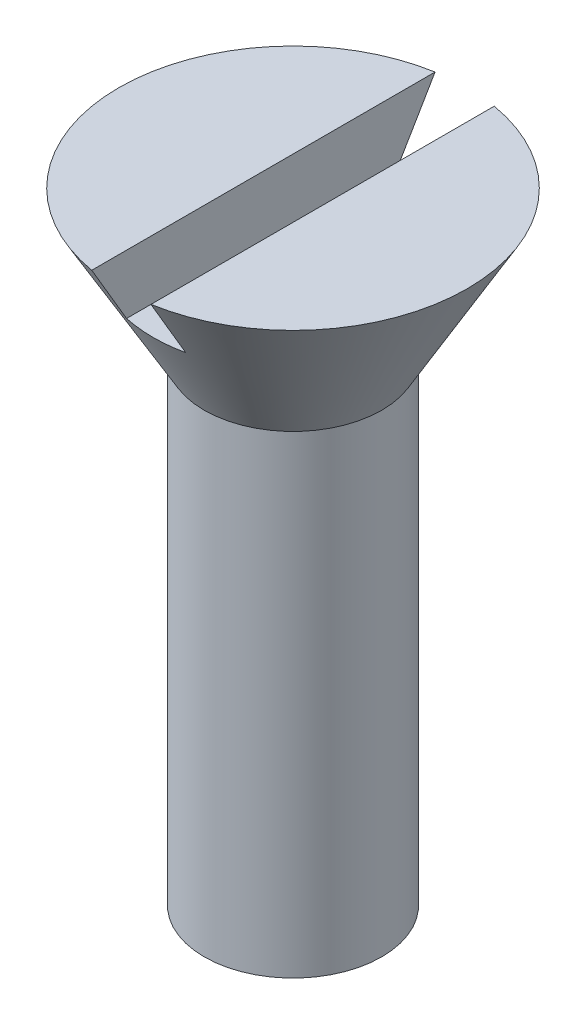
ISO-10303-21;
HEADER;
FILE_DESCRIPTION(('STEP AP214'),'2;1');
FILE_NAME('part.step','',(''),(''),'','','');
FILE_SCHEMA(('AUTOMOTIVE_DESIGN { 1 0 10303 214 1 1 1 1 }'));
ENDSEC;
DATA;
#1=APPLICATION_CONTEXT('core data for automotive mechanical design processes');
#2=APPLICATION_PROTOCOL_DEFINITION('international standard','automotive_design',2000,#1);
#3=PRODUCT_CONTEXT('',#1,'mechanical');
#4=PRODUCT('Part','Part','',(#3));
#5=PRODUCT_RELATED_PRODUCT_CATEGORY('part','',(#4));
#6=PRODUCT_DEFINITION_FORMATION('','',#4);
#7=PRODUCT_DEFINITION_CONTEXT('part definition',#1,'design');
#8=PRODUCT_DEFINITION('design','',#6,#7);
#9=PRODUCT_DEFINITION_SHAPE('','',#8);
#10=(LENGTH_UNIT() NAMED_UNIT(*) SI_UNIT(.MILLI.,.METRE.));
#11=(NAMED_UNIT(*) PLANE_ANGLE_UNIT() SI_UNIT($,.RADIAN.));
#12=(NAMED_UNIT(*) SI_UNIT($,.STERADIAN.) SOLID_ANGLE_UNIT());
#13=UNCERTAINTY_MEASURE_WITH_UNIT(LENGTH_MEASURE(1.E-05),#10,'distance_accuracy_value','');
#14=(GEOMETRIC_REPRESENTATION_CONTEXT(3) GLOBAL_UNCERTAINTY_ASSIGNED_CONTEXT((#13)) GLOBAL_UNIT_ASSIGNED_CONTEXT((#10,
#11,#12)) REPRESENTATION_CONTEXT('',''));
#15=CARTESIAN_POINT('',(0.,0.,0.));
#16=DIRECTION('',(0.,0.,1.));
#17=DIRECTION('',(1.,0.,0.));
#18=AXIS2_PLACEMENT_3D('',#15,#16,#17);
#19=CARTESIAN_POINT('',(0.,21.,0.));
#20=DIRECTION('',(0.,1.,0.));
#21=DIRECTION('',(0.,0.,1.));
#22=AXIS2_PLACEMENT_3D('',#19,#20,#21);
#23=PLANE('',#22);
#24=DIRECTION('',(0.,0.,-1.));
#25=VECTOR('',#24,1.);
#26=CARTESIAN_POINT('',(1.,21.,0.));
#27=LINE('',#26,#25);
#28=CARTESIAN_POINT('',(1.,21.,5.8011931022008));
#29=VERTEX_POINT('',#28);
#30=CARTESIAN_POINT('',(1.,21.,-5.8011931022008));
#31=VERTEX_POINT('',#30);
#32=EDGE_CURVE('E79',#29,#31,#27,.T.);
#33=ORIENTED_EDGE('',*,*,#32,.F.);
#34=CARTESIAN_POINT('',(0.,21.,0.));
#35=DIRECTION('',(0.,1.,0.));
#36=DIRECTION('',(0.,0.,1.));
#37=AXIS2_PLACEMENT_3D('',#34,#35,#36);
#38=CIRCLE('',#37,5.88675134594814);
#39=EDGE_CURVE('E91',#29,#31,#38,.T.);
#40=ORIENTED_EDGE('',*,*,#39,.T.);
#41=EDGE_LOOP('',(#33,#40));
#42=FACE_BOUND('',#41,.T.);
#43=ADVANCED_FACE('F32',(#42),#23,.T.);
#44=CARTESIAN_POINT('',(0.,16.,0.));
#45=DIRECTION('',(0.,-1.,0.));
#46=DIRECTION('',(0.,0.,-1.));
#47=AXIS2_PLACEMENT_3D('',#44,#45,#46);
#48=CYLINDRICAL_SURFACE('',#47,3.);
#49=CARTESIAN_POINT('',(0.,16.,0.));
#50=DIRECTION('',(0.,1.,0.));
#51=DIRECTION('',(0.,0.,1.));
#52=AXIS2_PLACEMENT_3D('',#49,#50,#51);
#53=CIRCLE('',#52,3.);
#54=CARTESIAN_POINT('',(0.,16.,3.));
#55=VERTEX_POINT('',#54);
#56=EDGE_CURVE('E80',#55,#55,#53,.T.);
#57=ORIENTED_EDGE('',*,*,#56,.F.);
#58=EDGE_LOOP('',(#57));
#59=FACE_BOUND('',#58,.T.);
#60=CARTESIAN_POINT('',(0.,0.,0.));
#61=DIRECTION('',(0.,-1.,0.));
#62=DIRECTION('',(0.,0.,-1.));
#63=AXIS2_PLACEMENT_3D('',#60,#61,#62);
#64=CIRCLE('',#63,3.);
#65=CARTESIAN_POINT('',(0.,0.,-3.));
#66=VERTEX_POINT('',#65);
#67=EDGE_CURVE('E92',#66,#66,#64,.T.);
#68=ORIENTED_EDGE('',*,*,#67,.F.);
#69=EDGE_LOOP('',(#68));
#70=FACE_BOUND('',#69,.T.);
#71=ADVANCED_FACE('F34',(#59,#70),#48,.T.);
#72=CARTESIAN_POINT('',(0.,16.,0.));
#73=DIRECTION('',(0.,1.,0.));
#74=DIRECTION('',(0.,0.,1.));
#75=AXIS2_PLACEMENT_3D('',#72,#73,#74);
#76=CONICAL_SURFACE('',#75,3.,0.5235987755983);
#77=ORIENTED_EDGE('',*,*,#39,.F.);
#78=CARTESIAN_POINT('',(1.,28.1655005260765,9.97374876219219));
#79=CARTESIAN_POINT('',(1.,27.686679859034,9.69591018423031));
#80=CARTESIAN_POINT('',(1.,27.207904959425,9.41799266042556));
#81=CARTESIAN_POINT('',(1.,26.2504855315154,8.86193069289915));
#82=CARTESIAN_POINT('',(1.,25.7718410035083,8.58378624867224));
#83=CARTESIAN_POINT('',(1.,24.814644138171,8.02715662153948));
#84=CARTESIAN_POINT('',(1.,24.3360918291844,7.74867138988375));
#85=CARTESIAN_POINT('',(1.,23.3792242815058,7.1912959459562));
#86=CARTESIAN_POINT('',(1.,22.9009090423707,6.9124057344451));
#87=CARTESIAN_POINT('',(1.,21.9390135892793,6.35078135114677));
#88=CARTESIAN_POINT('',(1.,21.4554373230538,6.0680404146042));
#89=CARTESIAN_POINT('',(1.,20.4887990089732,5.50167446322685));
#90=CARTESIAN_POINT('',(1.,20.0057369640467,5.21804944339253));
#91=CARTESIAN_POINT('',(1.,19.040488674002,4.64944509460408));
#92=CARTESIAN_POINT('',(1.,18.5583023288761,4.36446593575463));
#93=CARTESIAN_POINT('',(1.,17.8361219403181,3.93515286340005));
#94=CARTESIAN_POINT('',(1.,17.5955795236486,3.79174183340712));
#95=CARTESIAN_POINT('',(1.,17.1150128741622,3.50405412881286));
#96=CARTESIAN_POINT('',(1.,16.874988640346,3.35977745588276));
#97=CARTESIAN_POINT('',(1.,16.3976602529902,3.07116716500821));
#98=CARTESIAN_POINT('',(1.,16.1603499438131,2.92684373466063));
#99=CARTESIAN_POINT('',(1.,15.6868095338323,2.63632771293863));
#100=CARTESIAN_POINT('',(1.,15.4505796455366,2.49013477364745));
#101=CARTESIAN_POINT('',(1.,15.0980067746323,2.26879280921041));
#102=CARTESIAN_POINT('',(1.,14.9809502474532,2.19478142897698));
#103=CARTESIAN_POINT('',(1.,14.7474809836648,2.04575133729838));
#104=CARTESIAN_POINT('',(1.,14.6310682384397,1.97073263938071));
#105=CARTESIAN_POINT('',(1.,14.3991751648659,1.8193519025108));
#106=CARTESIAN_POINT('',(1.,14.2836945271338,1.74299033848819));
#107=CARTESIAN_POINT('',(1.,14.0540327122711,1.58834232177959));
#108=CARTESIAN_POINT('',(1.,13.9398514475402,1.51005599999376));
#109=CARTESIAN_POINT('',(1.,13.7492013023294,1.37574539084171));
#110=CARTESIAN_POINT('',(1.,13.6721952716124,1.32048649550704));
#111=CARTESIAN_POINT('',(1.,13.5195042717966,1.20809051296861));
#112=CARTESIAN_POINT('',(1.,13.4438199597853,1.15095253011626));
#113=CARTESIAN_POINT('',(1.,13.2939773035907,1.03368691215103));
#114=CARTESIAN_POINT('',(1.,13.2198320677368,0.973542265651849));
#115=CARTESIAN_POINT('',(1.,13.1111691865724,0.88039522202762));
#116=CARTESIAN_POINT('',(1.,13.0753877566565,0.848870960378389));
#117=CARTESIAN_POINT('',(1.,13.0049547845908,0.784589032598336));
#118=CARTESIAN_POINT('',(1.,12.9703030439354,0.75183158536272));
#119=CARTESIAN_POINT('',(1.,12.9019258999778,0.684163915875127));
#120=CARTESIAN_POINT('',(1.,12.8682278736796,0.649225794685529));
#121=CARTESIAN_POINT('',(1.,12.8031053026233,0.577307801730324));
#122=CARTESIAN_POINT('',(1.,12.7716791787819,0.540329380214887));
#123=CARTESIAN_POINT('',(1.,12.7124587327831,0.464128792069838));
#124=CARTESIAN_POINT('',(1.,12.6846307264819,0.424933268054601));
#125=CARTESIAN_POINT('',(1.,12.6340307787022,0.343457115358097));
#126=CARTESIAN_POINT('',(1.,12.6112431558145,0.301186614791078));
#127=CARTESIAN_POINT('',(1.,12.5769379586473,0.221653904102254));
#128=CARTESIAN_POINT('',(1.,12.5640986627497,0.184979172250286));
#129=CARTESIAN_POINT('',(1.,12.5451600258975,0.10994869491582));
#130=CARTESIAN_POINT('',(1.,12.5390431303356,0.0715976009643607));
#131=CARTESIAN_POINT('',(1.,12.5346257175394,-0.00583623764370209));
#132=CARTESIAN_POINT('',(1.,12.5363777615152,-0.0449221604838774));
#133=CARTESIAN_POINT('',(1.,12.547468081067,-0.122034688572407));
#134=CARTESIAN_POINT('',(1.,12.5568246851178,-0.160058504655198));
#135=CARTESIAN_POINT('',(1.,12.5850650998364,-0.244440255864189));
#136=CARTESIAN_POINT('',(1.,12.6058915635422,-0.290124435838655));
#137=CARTESIAN_POINT('',(1.,12.6540347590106,-0.377905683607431));
#138=CARTESIAN_POINT('',(1.,12.6813694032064,-0.419992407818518));
#139=CARTESIAN_POINT('',(1.,12.7331794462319,-0.491485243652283));
#140=CARTESIAN_POINT('',(1.,12.7567949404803,-0.521531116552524));
#141=CARTESIAN_POINT('',(1.,12.8057903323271,-0.580157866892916));
#142=CARTESIAN_POINT('',(1.,12.8311709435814,-0.608738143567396));
#143=CARTESIAN_POINT('',(1.,12.9093435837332,-0.692790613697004));
#144=CARTESIAN_POINT('',(1.,12.9640714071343,-0.746451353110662));
#145=CARTESIAN_POINT('',(1.,13.0769206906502,-0.850850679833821));
#146=CARTESIAN_POINT('',(1.,13.1350641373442,-0.901564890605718));
#147=CARTESIAN_POINT('',(1.,13.2237160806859,-0.975827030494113));
#148=CARTESIAN_POINT('',(1.,13.2534861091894,-1.00026404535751));
#149=CARTESIAN_POINT('',(1.,13.3134337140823,-1.04863072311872));
#150=CARTESIAN_POINT('',(1.,13.3436112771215,-1.07256040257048));
#151=CARTESIAN_POINT('',(1.,13.4453419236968,-1.15206390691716));
#152=CARTESIAN_POINT('',(1.,13.5176552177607,-1.20666482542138));
#153=CARTESIAN_POINT('',(1.,13.6635346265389,-1.31417121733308));
#154=CARTESIAN_POINT('',(1.,13.737100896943,-1.36707647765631));
#155=CARTESIAN_POINT('',(1.,13.8851532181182,-1.47163916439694));
#156=CARTESIAN_POINT('',(1.,13.9596395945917,-1.52329612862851));
#157=CARTESIAN_POINT('',(1.,14.1092772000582,-1.62563941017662));
#158=CARTESIAN_POINT('',(1.,14.1844284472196,-1.67632570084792));
#159=CARTESIAN_POINT('',(1.,14.410875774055,-1.82741818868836));
#160=CARTESIAN_POINT('',(1.,14.562926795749,-1.92669179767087));
#161=CARTESIAN_POINT('',(1.,14.8682384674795,-2.12327464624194));
#162=CARTESIAN_POINT('',(1.,15.021498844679,-2.22058431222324));
#163=CARTESIAN_POINT('',(1.,15.328113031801,-2.41338835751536));
#164=CARTESIAN_POINT('',(1.,15.481462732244,-2.50888928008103));
#165=CARTESIAN_POINT('',(1.,15.7887611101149,-2.69894010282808));
#166=CARTESIAN_POINT('',(1.,15.9427098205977,-2.79348994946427));
#167=CARTESIAN_POINT('',(1.,16.2509055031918,-2.98179376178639));
#168=CARTESIAN_POINT('',(1.,16.4051520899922,-3.07554835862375));
#169=CARTESIAN_POINT('',(1.,16.7139719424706,-3.26251114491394));
#170=CARTESIAN_POINT('',(1.,16.868545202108,-3.35571934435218));
#171=CARTESIAN_POINT('',(1.,17.2533405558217,-3.5870336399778));
#172=CARTESIAN_POINT('',(1.,17.4837171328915,-3.72488267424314));
#173=CARTESIAN_POINT('',(1.,17.944872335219,-3.99990685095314));
#174=CARTESIAN_POINT('',(1.,18.1756509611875,-4.13708199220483));
#175=CARTESIAN_POINT('',(1.,18.8684317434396,-4.54786879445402));
#176=CARTESIAN_POINT('',(1.,19.330873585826,-4.8207387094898));
#177=CARTESIAN_POINT('',(1.,20.2566313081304,-5.36542115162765));
#178=CARTESIAN_POINT('',(1.,20.7199474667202,-5.63723320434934));
#179=CARTESIAN_POINT('',(1.,21.647024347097,-6.1800925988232));
#180=CARTESIAN_POINT('',(1.,22.1107850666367,-6.45113994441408));
#181=CARTESIAN_POINT('',(1.,23.0402829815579,-6.99369062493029));
#182=CARTESIAN_POINT('',(1.,23.5060212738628,-7.26519207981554));
#183=CARTESIAN_POINT('',(1.,24.4377167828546,-7.80782084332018));
#184=CARTESIAN_POINT('',(1.,24.9036739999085,-8.07894815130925));
#185=CARTESIAN_POINT('',(1.,25.8355409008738,-8.62080676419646));
#186=CARTESIAN_POINT('',(1.,26.30145051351,-8.89153819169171));
#187=CARTESIAN_POINT('',(1.,27.2333923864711,-9.43278774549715));
#188=CARTESIAN_POINT('',(1.,27.6994246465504,-9.70330587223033));
#189=CARTESIAN_POINT('',(1.,28.1655005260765,-9.97374876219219));
#190=B_SPLINE_CURVE_WITH_KNOTS('',3,(#78,#79,#80,#81,#82,#83,#84,#85,#86,#87,#88,#89,#90,#91,
#92,#93,#94,#95,#96,#97,#98,#99,#100,#101,#102,#103,#104,#105,#106,#107,#108,#109,#110,#111,
#112,#113,#114,#115,#116,#117,#118,#119,#120,#121,#122,#123,#124,#125,#126,#127,#128,#129,#130,
#131,#132,#133,#134,#135,#136,#137,#138,#139,#140,#141,#142,#143,#144,#145,#146,#147,#148,#149,
#150,#151,#152,#153,#154,#155,#156,#157,#158,#159,#160,#161,#162,#163,#164,#165,#166,#167,#168,
#169,#170,#171,#172,#173,#174,#175,#176,#177,#178,#179,#180,#181,#182,#183,#184,#185,#186,#187,
#188,#189),.UNSPECIFIED.,.F.,.F.,(4,2,2,2,2,2,2,2,2,2,2,2,2,2,2,2,2,2,2,2,2,2,2,2,2,2,2,2,2,2,2,
2,2,2,2,2,2,2,2,2,2,2,2,2,2,2,2,2,2,2,2,2,2,2,2,4),(0.,1.66077443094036,3.32155256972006,
4.98260540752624,6.64365512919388,8.32415911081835,10.0046726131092,11.6849803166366,
12.5251258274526,13.3652697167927,14.1985176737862,15.0319230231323,15.44739417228,
15.862859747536,16.2781812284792,16.69347454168,16.9777975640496,17.2622581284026,
17.5485667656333,17.6916075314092,17.8346230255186,17.9801781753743,18.1256311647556,
18.26960494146,18.4131242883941,18.5292057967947,18.6449834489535,18.7615355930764,
18.8783694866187,19.0281520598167,19.1783517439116,19.2929216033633,19.407538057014,
19.6372353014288,19.8686208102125,19.9841614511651,20.0996983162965,20.3714921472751,
20.6433200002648,20.915247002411,21.1871814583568,21.7319226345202,22.2765442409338,
22.8185068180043,23.360499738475,23.9020122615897,24.4435148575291,25.2489207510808,
26.0543280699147,27.6651609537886,29.2766479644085,30.8881268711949,32.5054166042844,
34.1227090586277,35.7392811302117,37.3558499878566),.UNSPECIFIED.);
#191=CARTESIAN_POINT('',(1.,19.,4.62518160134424));
#192=VERTEX_POINT('',#191);
#193=EDGE_CURVE('E96',#29,#192,#190,.T.);
#194=ORIENTED_EDGE('',*,*,#193,.T.);
#195=CARTESIAN_POINT('',(0.,19.,0.));
#196=DIRECTION('',(0.,-1.,0.));
#197=DIRECTION('',(0.,0.,-1.));
#198=AXIS2_PLACEMENT_3D('',#195,#196,#197);
#199=CIRCLE('',#198,4.73205080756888);
#200=CARTESIAN_POINT('',(-1.,19.,4.62518160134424));
#201=VERTEX_POINT('',#200);
#202=EDGE_CURVE('E11',#192,#201,#199,.T.);
#203=ORIENTED_EDGE('',*,*,#202,.T.);
#204=CARTESIAN_POINT('',(-1.,28.1655005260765,-9.97374876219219));
#205=CARTESIAN_POINT('',(-1.,27.686679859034,-9.69591018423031));
#206=CARTESIAN_POINT('',(-1.,27.207904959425,-9.41799266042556));
#207=CARTESIAN_POINT('',(-1.,26.2504855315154,-8.86193069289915));
#208=CARTESIAN_POINT('',(-1.,25.7718410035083,-8.58378624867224));
#209=CARTESIAN_POINT('',(-1.,24.814644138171,-8.02715662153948));
#210=CARTESIAN_POINT('',(-1.,24.3360918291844,-7.74867138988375));
#211=CARTESIAN_POINT('',(-1.,23.3792242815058,-7.1912959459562));
#212=CARTESIAN_POINT('',(-1.,22.9009090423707,-6.9124057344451));
#213=CARTESIAN_POINT('',(-1.,21.9390135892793,-6.35078135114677));
#214=CARTESIAN_POINT('',(-1.,21.4554373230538,-6.0680404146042));
#215=CARTESIAN_POINT('',(-1.,20.4887990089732,-5.50167446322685));
#216=CARTESIAN_POINT('',(-1.,20.0057369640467,-5.21804944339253));
#217=CARTESIAN_POINT('',(-1.,19.040488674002,-4.64944509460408));
#218=CARTESIAN_POINT('',(-1.,18.5583023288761,-4.36446593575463));
#219=CARTESIAN_POINT('',(-1.,17.8361219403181,-3.93515286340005));
#220=CARTESIAN_POINT('',(-1.,17.5955795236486,-3.79174183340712));
#221=CARTESIAN_POINT('',(-1.,17.1150128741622,-3.50405412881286));
#222=CARTESIAN_POINT('',(-1.,16.874988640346,-3.35977745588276));
#223=CARTESIAN_POINT('',(-1.,16.3976602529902,-3.07116716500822));
#224=CARTESIAN_POINT('',(-1.,16.1603499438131,-2.92684373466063));
#225=CARTESIAN_POINT('',(-1.,15.6868095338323,-2.63632771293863));
#226=CARTESIAN_POINT('',(-1.,15.4505796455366,-2.49013477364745));
#227=CARTESIAN_POINT('',(-1.,15.0980067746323,-2.26879280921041));
#228=CARTESIAN_POINT('',(-1.,14.9809502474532,-2.19478142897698));
#229=CARTESIAN_POINT('',(-1.,14.7474809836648,-2.04575133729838));
#230=CARTESIAN_POINT('',(-1.,14.6310682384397,-1.97073263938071));
#231=CARTESIAN_POINT('',(-1.,14.3991751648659,-1.8193519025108));
#232=CARTESIAN_POINT('',(-1.,14.2836945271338,-1.74299033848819));
#233=CARTESIAN_POINT('',(-1.,14.0540327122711,-1.58834232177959));
#234=CARTESIAN_POINT('',(-1.,13.9398514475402,-1.51005599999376));
#235=CARTESIAN_POINT('',(-1.,13.7492013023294,-1.37574539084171));
#236=CARTESIAN_POINT('',(-1.,13.6721952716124,-1.32048649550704));
#237=CARTESIAN_POINT('',(-1.,13.5195042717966,-1.20809051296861));
#238=CARTESIAN_POINT('',(-1.,13.4438199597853,-1.15095253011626));
#239=CARTESIAN_POINT('',(-1.,13.2939773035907,-1.03368691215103));
#240=CARTESIAN_POINT('',(-1.,13.2198320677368,-0.97354226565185));
#241=CARTESIAN_POINT('',(-1.,13.1111691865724,-0.880395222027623));
#242=CARTESIAN_POINT('',(-1.,13.0753877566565,-0.848870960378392));
#243=CARTESIAN_POINT('',(-1.,13.0049547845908,-0.784589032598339));
#244=CARTESIAN_POINT('',(-1.,12.9703030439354,-0.751831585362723));
#245=CARTESIAN_POINT('',(-1.,12.9019258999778,-0.684163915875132));
#246=CARTESIAN_POINT('',(-1.,12.8682278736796,-0.649225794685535));
#247=CARTESIAN_POINT('',(-1.,12.8031053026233,-0.577307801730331));
#248=CARTESIAN_POINT('',(-1.,12.7716791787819,-0.540329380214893));
#249=CARTESIAN_POINT('',(-1.,12.7124587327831,-0.464128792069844));
#250=CARTESIAN_POINT('',(-1.,12.6846307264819,-0.424933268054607));
#251=CARTESIAN_POINT('',(-1.,12.6340307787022,-0.343457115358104));
#252=CARTESIAN_POINT('',(-1.,12.6112431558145,-0.301186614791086));
#253=CARTESIAN_POINT('',(-1.,12.5769379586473,-0.221653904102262));
#254=CARTESIAN_POINT('',(-1.,12.5640986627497,-0.184979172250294));
#255=CARTESIAN_POINT('',(-1.,12.5451600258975,-0.109948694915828));
#256=CARTESIAN_POINT('',(-1.,12.5390431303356,-0.0715976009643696));
#257=CARTESIAN_POINT('',(-1.,12.5346257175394,0.0058362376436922));
#258=CARTESIAN_POINT('',(-1.,12.5363777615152,0.0449221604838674));
#259=CARTESIAN_POINT('',(-1.,12.547468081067,0.122034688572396));
#260=CARTESIAN_POINT('',(-1.,12.5568246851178,0.160058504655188));
#261=CARTESIAN_POINT('',(-1.,12.5850650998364,0.244440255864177));
#262=CARTESIAN_POINT('',(-1.,12.6058915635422,0.290124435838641));
#263=CARTESIAN_POINT('',(-1.,12.6540347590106,0.377905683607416));
#264=CARTESIAN_POINT('',(-1.,12.6813694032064,0.419992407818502));
#265=CARTESIAN_POINT('',(-1.,12.7331794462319,0.491485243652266));
#266=CARTESIAN_POINT('',(-1.,12.7567949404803,0.521531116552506));
#267=CARTESIAN_POINT('',(-1.,12.8057903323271,0.580157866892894));
#268=CARTESIAN_POINT('',(-1.,12.8311709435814,0.608738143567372));
#269=CARTESIAN_POINT('',(-1.,12.9093435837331,0.692790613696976));
#270=CARTESIAN_POINT('',(-1.,12.9640714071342,0.746451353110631));
#271=CARTESIAN_POINT('',(-1.,13.0769206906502,0.850850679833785));
#272=CARTESIAN_POINT('',(-1.,13.1350641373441,0.90156489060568));
#273=CARTESIAN_POINT('',(-1.,13.2237160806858,0.97582703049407));
#274=CARTESIAN_POINT('',(-1.,13.2534861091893,1.00026404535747));
#275=CARTESIAN_POINT('',(-1.,13.3134337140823,1.04863072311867));
#276=CARTESIAN_POINT('',(-1.,13.3436112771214,1.07256040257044));
#277=CARTESIAN_POINT('',(-1.,13.4453419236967,1.15206390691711));
#278=CARTESIAN_POINT('',(-1.,13.5176552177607,1.20666482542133));
#279=CARTESIAN_POINT('',(-1.,13.6635346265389,1.31417121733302));
#280=CARTESIAN_POINT('',(-1.,13.7371008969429,1.36707647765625));
#281=CARTESIAN_POINT('',(-1.,13.8851532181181,1.47163916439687));
#282=CARTESIAN_POINT('',(-1.,13.9596395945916,1.52329612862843));
#283=CARTESIAN_POINT('',(-1.,14.1092772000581,1.62563941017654));
#284=CARTESIAN_POINT('',(-1.,14.1844284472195,1.67632570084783));
#285=CARTESIAN_POINT('',(-1.,14.4108757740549,1.82741818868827));
#286=CARTESIAN_POINT('',(-1.,14.5629267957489,1.92669179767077));
#287=CARTESIAN_POINT('',(-1.,14.8682384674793,2.12327464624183));
#288=CARTESIAN_POINT('',(-1.,15.0214988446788,2.22058431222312));
#289=CARTESIAN_POINT('',(-1.,15.3281130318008,2.41338835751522));
#290=CARTESIAN_POINT('',(-1.,15.4814627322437,2.50888928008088));
#291=CARTESIAN_POINT('',(-1.,15.7887611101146,2.69894010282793));
#292=CARTESIAN_POINT('',(-1.,15.9427098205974,2.79348994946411));
#293=CARTESIAN_POINT('',(-1.,16.2509055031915,2.98179376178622));
#294=CARTESIAN_POINT('',(-1.,16.4051520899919,3.07554835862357));
#295=CARTESIAN_POINT('',(-1.,16.7139719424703,3.26251114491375));
#296=CARTESIAN_POINT('',(-1.,16.8685452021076,3.35571934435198));
#297=CARTESIAN_POINT('',(-1.,17.2533405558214,3.5870336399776));
#298=CARTESIAN_POINT('',(-1.,17.4837171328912,3.72488267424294));
#299=CARTESIAN_POINT('',(-1.,17.9448723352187,3.99990685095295));
#300=CARTESIAN_POINT('',(-1.,18.1756509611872,4.13708199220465));
#301=CARTESIAN_POINT('',(-1.,18.8684317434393,4.54786879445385));
#302=CARTESIAN_POINT('',(-1.,19.3308735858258,4.82073870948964));
#303=CARTESIAN_POINT('',(-1.,20.2566313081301,5.36542115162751));
#304=CARTESIAN_POINT('',(-1.,20.71994746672,5.63723320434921));
#305=CARTESIAN_POINT('',(-1.,21.6470243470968,6.18009259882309));
#306=CARTESIAN_POINT('',(-1.,22.1107850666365,6.45113994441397));
#307=CARTESIAN_POINT('',(-1.,23.0402829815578,6.9936906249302));
#308=CARTESIAN_POINT('',(-1.,23.5060212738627,7.26519207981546));
#309=CARTESIAN_POINT('',(-1.,24.4377167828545,7.80782084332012));
#310=CARTESIAN_POINT('',(-1.,24.9036739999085,8.0789481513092));
#311=CARTESIAN_POINT('',(-1.,25.8355409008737,8.62080676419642));
#312=CARTESIAN_POINT('',(-1.,26.30145051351,8.89153819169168));
#313=CARTESIAN_POINT('',(-1.,27.2333923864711,9.43278774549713));
#314=CARTESIAN_POINT('',(-1.,27.6994246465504,9.70330587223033));
#315=CARTESIAN_POINT('',(-1.,28.1655005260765,9.97374876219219));
#316=B_SPLINE_CURVE_WITH_KNOTS('',3,(#204,#205,#206,#207,#208,#209,#210,#211,#212,#213,#214,
#215,#216,#217,#218,#219,#220,#221,#222,#223,#224,#225,#226,#227,#228,#229,#230,#231,#232,#233,
#234,#235,#236,#237,#238,#239,#240,#241,#242,#243,#244,#245,#246,#247,#248,#249,#250,#251,#252,
#253,#254,#255,#256,#257,#258,#259,#260,#261,#262,#263,#264,#265,#266,#267,#268,#269,#270,#271,
#272,#273,#274,#275,#276,#277,#278,#279,#280,#281,#282,#283,#284,#285,#286,#287,#288,#289,#290,
#291,#292,#293,#294,#295,#296,#297,#298,#299,#300,#301,#302,#303,#304,#305,#306,#307,#308,#309,
#310,#311,#312,#313,#314,#315),.UNSPECIFIED.,.F.,.F.,(4,2,2,2,2,2,2,2,2,2,2,2,2,2,2,2,2,2,2,2,2,
2,2,2,2,2,2,2,2,2,2,2,2,2,2,2,2,2,2,2,2,2,2,2,2,2,2,2,2,2,2,2,2,2,2,4),(0.,1.66077443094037,
3.32155256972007,4.98260540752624,6.64365512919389,8.32415911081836,10.0046726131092,
11.6849803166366,12.5251258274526,13.3652697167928,14.1985176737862,15.0319230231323,
15.44739417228,15.862859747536,16.2781812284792,16.69347454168,16.9777975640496,
17.2622581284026,17.5485667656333,17.6916075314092,17.8346230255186,17.9801781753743,
18.1256311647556,18.26960494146,18.4131242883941,18.5292057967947,18.6449834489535,
18.7615355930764,18.8783694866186,19.0281520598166,19.1783517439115,19.2929216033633,
19.407538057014,19.6372353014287,19.8686208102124,19.984161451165,20.0996983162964,
20.371492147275,20.6433200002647,20.9152470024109,21.1871814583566,21.73192263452,
22.2765442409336,22.818506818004,23.3604997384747,23.9020122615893,24.4435148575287,
25.2489207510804,26.0543280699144,27.6651609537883,29.2766479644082,30.8881268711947,
32.5054166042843,34.1227090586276,35.7392811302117,37.3558499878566),.UNSPECIFIED.);
#317=CARTESIAN_POINT('',(-1.,21.,5.8011931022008));
#318=VERTEX_POINT('',#317);
#319=EDGE_CURVE('E74',#201,#318,#316,.T.);
#320=ORIENTED_EDGE('',*,*,#319,.T.);
#321=CARTESIAN_POINT('',(-1.,21.,-5.8011931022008));
#322=VERTEX_POINT('',#321);
#323=EDGE_CURVE('E86',#322,#318,#38,.T.);
#324=ORIENTED_EDGE('',*,*,#323,.F.);
#325=CARTESIAN_POINT('',(-1.,19.,-4.62518160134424));
#326=VERTEX_POINT('',#325);
#327=EDGE_CURVE('E47',#322,#326,#316,.T.);
#328=ORIENTED_EDGE('',*,*,#327,.T.);
#329=CARTESIAN_POINT('',(1.,19.,-4.62518160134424));
#330=VERTEX_POINT('',#329);
#331=EDGE_CURVE('E36',#326,#330,#199,.T.);
#332=ORIENTED_EDGE('',*,*,#331,.T.);
#333=EDGE_CURVE('E105',#330,#31,#190,.T.);
#334=ORIENTED_EDGE('',*,*,#333,.T.);
#335=EDGE_LOOP('',(#77,#194,#203,#320,#324,#328,#332,#334));
#336=FACE_BOUND('',#335,.T.);
#337=ORIENTED_EDGE('',*,*,#56,.T.);
#338=EDGE_LOOP('',(#337));
#339=FACE_BOUND('',#338,.T.);
#340=ADVANCED_FACE('F84',(#336,#339),#76,.T.);
#341=DIRECTION('',(0.,0.,1.));
#342=VECTOR('',#341,1.);
#343=CARTESIAN_POINT('',(-1.,21.,0.));
#344=LINE('',#343,#342);
#345=EDGE_CURVE('E71',#322,#318,#344,.T.);
#346=ORIENTED_EDGE('',*,*,#345,.F.);
#347=ORIENTED_EDGE('',*,*,#323,.T.);
#348=EDGE_LOOP('',(#346,#347));
#349=FACE_BOUND('',#348,.T.);
#350=ADVANCED_FACE('F90',(#349),#23,.T.);
#351=CARTESIAN_POINT('',(0.,0.,0.));
#352=DIRECTION('',(0.,1.,0.));
#353=DIRECTION('',(0.,0.,-1.));
#354=AXIS2_PLACEMENT_3D('',#351,#352,#353);
#355=CONICAL_SURFACE('',#354,3.,1.0471975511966);
#356=CARTESIAN_POINT('',(0.,-1.73205080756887,0.));
#357=VERTEX_POINT('',#356);
#358=VERTEX_LOOP('',#357);
#359=FACE_BOUND('',#358,.T.);
#360=ORIENTED_EDGE('',*,*,#67,.T.);
#361=EDGE_LOOP('',(#360));
#362=FACE_BOUND('',#361,.T.);
#363=ADVANCED_FACE('F130',(#359,#362),#355,.T.);
#364=CARTESIAN_POINT('',(1.,19.,-6.75678328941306));
#365=DIRECTION('',(0.,-1.,0.));
#366=DIRECTION('',(0.,0.,-1.));
#367=AXIS2_PLACEMENT_3D('',#364,#365,#366);
#368=PLANE('',#367);
#369=DIRECTION('',(0.,0.,-1.));
#370=VECTOR('',#369,1.);
#371=CARTESIAN_POINT('',(1.,19.,6.75678328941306));
#372=LINE('',#371,#370);
#373=EDGE_CURVE('E110',#192,#330,#372,.T.);
#374=ORIENTED_EDGE('',*,*,#373,.T.);
#375=ORIENTED_EDGE('',*,*,#331,.F.);
#376=DIRECTION('',(0.,0.,1.));
#377=VECTOR('',#376,1.);
#378=CARTESIAN_POINT('',(-1.,19.,6.75678328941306));
#379=LINE('',#378,#377);
#380=EDGE_CURVE('E88',#326,#201,#379,.T.);
#381=ORIENTED_EDGE('',*,*,#380,.T.);
#382=ORIENTED_EDGE('',*,*,#202,.F.);
#383=EDGE_LOOP('',(#374,#375,#381,#382));
#384=FACE_BOUND('',#383,.T.);
#385=ADVANCED_FACE('F108',(#384),#368,.F.);
#386=CARTESIAN_POINT('',(1.,19.,6.75678328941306));
#387=DIRECTION('',(1.,0.,0.));
#388=DIRECTION('',(0.,0.,-1.));
#389=AXIS2_PLACEMENT_3D('',#386,#387,#388);
#390=PLANE('',#389);
#391=ORIENTED_EDGE('',*,*,#32,.T.);
#392=ORIENTED_EDGE('',*,*,#333,.F.);
#393=ORIENTED_EDGE('',*,*,#373,.F.);
#394=ORIENTED_EDGE('',*,*,#193,.F.);
#395=EDGE_LOOP('',(#391,#392,#393,#394));
#396=FACE_BOUND('',#395,.T.);
#397=ADVANCED_FACE('F126',(#396),#390,.F.);
#398=CARTESIAN_POINT('',(-1.,19.,6.75678328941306));
#399=DIRECTION('',(-1.,0.,0.));
#400=DIRECTION('',(0.,0.,1.));
#401=AXIS2_PLACEMENT_3D('',#398,#399,#400);
#402=PLANE('',#401);
#403=ORIENTED_EDGE('',*,*,#345,.T.);
#404=ORIENTED_EDGE('',*,*,#319,.F.);
#405=ORIENTED_EDGE('',*,*,#380,.F.);
#406=ORIENTED_EDGE('',*,*,#327,.F.);
#407=EDGE_LOOP('',(#403,#404,#405,#406));
#408=FACE_BOUND('',#407,.T.);
#409=ADVANCED_FACE('F73',(#408),#402,.F.);
#410=CLOSED_SHELL('',(#43,#71,#340,#350,#363,#385,#397,#409));
#411=MANIFOLD_SOLID_BREP('B2',#410);
#412=ADVANCED_BREP_SHAPE_REPRESENTATION('',(#18,#411),#14);
#413=SHAPE_DEFINITION_REPRESENTATION(#9,#412);
ENDSEC;
END-ISO-10303-21;
